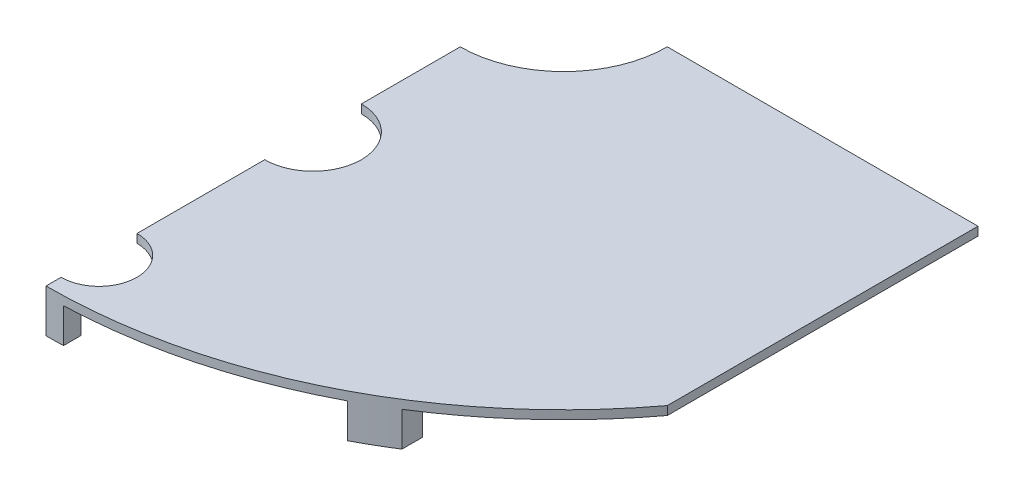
from build123d import *
from build123d.topology import SkipClean

# Parameters (mm, degrees)
BOSS_EXTRUDE1_DEPTH = 2.5
CUT_EXTRUDE2_DEPTH  = 10
BOSS_EXTRUDE2_START = 10
BOSS_EXTRUDE2_DEPTH = 10
CUT_EXTRUDE3_DEPTH  = 10
SKETCH6_W           = 184.610600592
SKETCH6_H           = 190.918263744
CUT_EXTRUDE4_DEPTH  = 159
CUT_EXTRUDE5_START  = -159
CUT_EXTRUDE5_DEPTH  = 159


with BuildPart() as part:
    # Sketch1 → Boss-Extrude1 (new body)
    with BuildSketch(Plane(origin=(0, 0, 0), x_dir=(1, 0, 0), z_dir=(0, 1, 0))):
        with BuildLine():
            ThreePointArc((30, 0), (0, -30), (-30, 0))
            Line((-30, 0), (-150, 0))
            ThreePointArc((-150, 0), (0, -150), (150, 0))
            Line((150, 0), (30, 0))
        make_face()
    extrude(amount=BOSS_EXTRUDE1_DEPTH)

    # Sketch3 → Cut-Extrude2 (cut)
    with BuildSketch(Plane(origin=(0, 2.5, 0), x_dir=(1, 0, 0), z_dir=(0, 1, 0))):
        with BuildLine():
            ThreePointArc((11, -134.640586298), (7.778174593, -126.862411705), (0, -123.640586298))
            Line((0, -123.640586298), (0, -145.640586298))
            ThreePointArc((0, -145.640586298), (7.778174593, -142.418760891), (11, -134.640586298))
        make_face()
        with BuildLine():
            Line((0, -145.640586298), (0, -123.640586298))
            ThreePointArc((0, -123.640586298), (-11, -134.640586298), (0, -145.640586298))
        make_face()
        with BuildLine():
            ThreePointArc((11, -134.640586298), (7.778174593, -126.862411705), (0, -123.640586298))
            Line((0, -123.640586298), (0, -145.640586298))
            ThreePointArc((0, -145.640586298), (7.778174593, -142.418760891), (11, -134.640586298))
        make_face()
        with BuildLine():
            Line((0, -145.640586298), (0, -123.640586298))
            ThreePointArc((0, -123.640586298), (-11, -134.640586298), (0, -145.640586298))
        make_face()
    extrude(amount=-CUT_EXTRUDE2_DEPTH, mode=Mode.SUBTRACT)

    # Sketch4 → Boss-Extrude2 (add)
    with SkipClean():  # the faces are left unmerged after this step: merging them gives an invalid solid
        with BuildSketch(Plane.XZ.offset(BOSS_EXTRUDE2_START)):
            with BuildLine():
                ThreePointArc((-80, 120.933866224), (-75.06098713, 124.059857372), (-70, 126.984250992))
                Line((-70, 126.984250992), (-70, 132.664991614))
                ThreePointArc((-70, 132.664991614), (-75.055644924, 129.871668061), (-80, 126.885775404))
                Line((-80, 126.885775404), (-80, 120.933866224))
            make_face()
            with BuildLine():
                ThreePointArc((3.83832231, 144.949188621), (4.419196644, 144.932641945), (5, 144.913767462))
                Line((5, 144.913767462), (5, 149.916643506))
                ThreePointArc((5, 149.916643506), (0, 150), (-5, 149.916643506))
                Line((-5, 149.916643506), (-5, 144.913767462))
                ThreePointArc((-5, 144.913767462), (-4.419196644, 144.932641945), (-3.83832231, 144.949188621))
                ThreePointArc((-3.83832231, 144.949188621), (0, 145.640586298), (3.83832231, 144.949188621))
            make_face()
            with BuildLine():
                Line((70, 132.664991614), (70, 126.984250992))
                ThreePointArc((70, 126.984250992), (75.06098713, 124.059857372), (80, 120.933866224))
                Line((80, 120.933866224), (80, 126.885775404))
                ThreePointArc((80, 126.885775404), (75.055644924, 129.871668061), (70, 132.664991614))
            make_face()
        extrude(amount=-BOSS_EXTRUDE2_DEPTH)

    # Sketch5 → Cut-Extrude3 (cut)
    with SkipClean():  # the faces are left unmerged after this step: merging them gives an invalid solid
        with BuildSketch(Plane(origin=(0, 2.5, 0), x_dir=(1, 0, 0), z_dir=(0, 1, 0))):
            with BuildLine():
                ThreePointArc((0, -58.640586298), (-14, -72.640586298), (0, -86.640586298))
                Line((0, -86.640586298), (0, -58.640586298))
            make_face()
            with BuildLine():
                Line((0, -58.640586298), (0, -86.640586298))
                ThreePointArc((0, -86.640586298), (9.899494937, -82.540081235), (14, -72.640586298))
                ThreePointArc((14, -72.640586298), (9.899494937, -62.741091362), (0, -58.640586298))
            make_face()
            with BuildLine():
                ThreePointArc((0, -58.640586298), (-14, -72.640586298), (0, -86.640586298))
                Line((0, -86.640586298), (0, -58.640586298))
            make_face()
            with BuildLine():
                Line((0, -58.640586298), (0, -86.640586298))
                ThreePointArc((0, -86.640586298), (9.899494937, -82.540081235), (14, -72.640586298))
                ThreePointArc((14, -72.640586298), (9.899494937, -62.741091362), (0, -58.640586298))
            make_face()
        extrude(amount=-CUT_EXTRUDE3_DEPTH, mode=Mode.SUBTRACT)

    # Sketch6 → Cut-Extrude4 (cut)
    with SkipClean():  # the faces are left unmerged after this step: merging them gives an invalid solid
        with BuildSketch(Plane(origin=(0, 2.5, 0), x_dir=(1, 0, 0), z_dir=(0, 1, 0))):
            with Locations((-92.305300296, -95.459131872)):
                Rectangle(SKETCH6_W, SKETCH6_H)
        extrude(amount=-CUT_EXTRUDE4_DEPTH, mode=Mode.SUBTRACT)

    # Sketch7 → Cut-Extrude5 (cut)
    with SkipClean():  # the faces are left unmerged after this step: merging them gives an invalid solid
        with BuildSketch(Plane(origin=(0, 2.5, 0), x_dir=(1, 0, 0), z_dir=(0, 1, 0)).offset(CUT_EXTRUDE5_START)):
            with BuildLine():
                Line((150, 0), (120, 0))
                Line((120, 0), (120, -90))
                ThreePointArc((120, -90), (142.302494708, -47.434164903), (150, 0))
            make_face()
        extrude(amount=CUT_EXTRUDE5_DEPTH, mode=Mode.SUBTRACT)


solid = part.part
